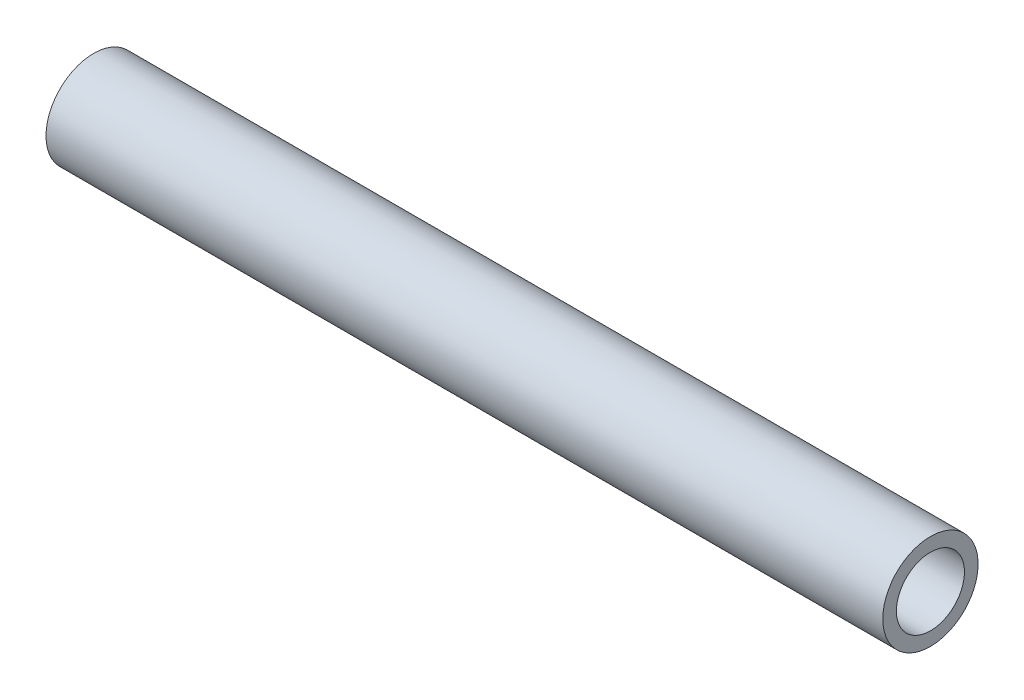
ISO-10303-21;
HEADER;
FILE_DESCRIPTION(('STEP AP214'),'2;1');
FILE_NAME('part.step','',(''),(''),'','','');
FILE_SCHEMA(('AUTOMOTIVE_DESIGN { 1 0 10303 214 1 1 1 1 }'));
ENDSEC;
DATA;
#1=APPLICATION_CONTEXT('core data for automotive mechanical design processes');
#2=APPLICATION_PROTOCOL_DEFINITION('international standard','automotive_design',2000,#1);
#3=PRODUCT_CONTEXT('',#1,'mechanical');
#4=PRODUCT('Part','Part','',(#3));
#5=PRODUCT_RELATED_PRODUCT_CATEGORY('part','',(#4));
#6=PRODUCT_DEFINITION_FORMATION('','',#4);
#7=PRODUCT_DEFINITION_CONTEXT('part definition',#1,'design');
#8=PRODUCT_DEFINITION('design','',#6,#7);
#9=PRODUCT_DEFINITION_SHAPE('','',#8);
#10=(LENGTH_UNIT() NAMED_UNIT(*) SI_UNIT(.MILLI.,.METRE.));
#11=(NAMED_UNIT(*) PLANE_ANGLE_UNIT() SI_UNIT($,.RADIAN.));
#12=(NAMED_UNIT(*) SI_UNIT($,.STERADIAN.) SOLID_ANGLE_UNIT());
#13=UNCERTAINTY_MEASURE_WITH_UNIT(LENGTH_MEASURE(1.E-05),#10,'distance_accuracy_value','');
#14=(GEOMETRIC_REPRESENTATION_CONTEXT(3) GLOBAL_UNCERTAINTY_ASSIGNED_CONTEXT((#13)) GLOBAL_UNIT_ASSIGNED_CONTEXT((#10,
#11,#12)) REPRESENTATION_CONTEXT('',''));
#15=CARTESIAN_POINT('',(0.,0.,0.));
#16=DIRECTION('',(0.,0.,1.));
#17=DIRECTION('',(1.,0.,0.));
#18=AXIS2_PLACEMENT_3D('',#15,#16,#17);
#19=CARTESIAN_POINT('',(187.325,0.,0.));
#20=DIRECTION('',(-1.,0.,0.));
#21=DIRECTION('',(0.,0.,1.));
#22=AXIS2_PLACEMENT_3D('',#19,#20,#21);
#23=CYLINDRICAL_SURFACE('',#22,7.62);
#24=CARTESIAN_POINT('',(187.325,0.,0.));
#25=DIRECTION('',(1.,0.,0.));
#26=DIRECTION('',(0.,0.,-1.));
#27=AXIS2_PLACEMENT_3D('',#24,#25,#26);
#28=CIRCLE('',#27,7.62);
#29=CARTESIAN_POINT('',(187.325,0.,7.62));
#30=VERTEX_POINT('',#29);
#31=EDGE_CURVE('E53',#30,#30,#28,.T.);
#32=CARTESIAN_POINT('',(0.,0.,0.));
#33=DIRECTION('',(1.,0.,0.));
#34=DIRECTION('',(0.,0.,-1.));
#35=AXIS2_PLACEMENT_3D('',#32,#33,#34);
#36=CIRCLE('',#35,7.62);
#37=CARTESIAN_POINT('',(0.,0.,7.62));
#38=VERTEX_POINT('',#37);
#39=EDGE_CURVE('E60',#38,#38,#36,.T.);
#40=CARTESIAN_POINT('',(187.325,0.,7.62));
#41=CARTESIAN_POINT('',(185.373697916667,0.,7.62));
#42=CARTESIAN_POINT('',(183.422395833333,0.,7.62));
#43=CARTESIAN_POINT('',(179.519791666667,0.,7.62));
#44=CARTESIAN_POINT('',(177.568489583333,0.,7.62));
#45=CARTESIAN_POINT('',(173.665885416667,0.,7.62));
#46=CARTESIAN_POINT('',(171.714583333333,0.,7.62));
#47=CARTESIAN_POINT('',(167.811979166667,0.,7.62));
#48=CARTESIAN_POINT('',(165.860677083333,0.,7.62));
#49=CARTESIAN_POINT('',(161.958072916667,0.,7.62));
#50=CARTESIAN_POINT('',(160.006770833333,0.,7.62));
#51=CARTESIAN_POINT('',(156.104166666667,0.,7.62));
#52=CARTESIAN_POINT('',(154.152864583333,0.,7.62));
#53=CARTESIAN_POINT('',(150.250260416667,0.,7.62));
#54=CARTESIAN_POINT('',(148.298958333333,0.,7.62));
#55=CARTESIAN_POINT('',(144.396354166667,0.,7.62));
#56=CARTESIAN_POINT('',(142.445052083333,0.,7.62));
#57=CARTESIAN_POINT('',(138.542447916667,0.,7.62));
#58=CARTESIAN_POINT('',(136.591145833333,0.,7.62));
#59=CARTESIAN_POINT('',(132.688541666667,0.,7.62));
#60=CARTESIAN_POINT('',(130.737239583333,0.,7.62));
#61=CARTESIAN_POINT('',(126.834635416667,0.,7.62));
#62=CARTESIAN_POINT('',(124.883333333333,0.,7.62));
#63=CARTESIAN_POINT('',(120.980729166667,0.,7.62));
#64=CARTESIAN_POINT('',(119.029427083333,0.,7.62));
#65=CARTESIAN_POINT('',(115.126822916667,0.,7.62));
#66=CARTESIAN_POINT('',(113.175520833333,0.,7.62));
#67=CARTESIAN_POINT('',(109.272916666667,0.,7.62));
#68=CARTESIAN_POINT('',(107.321614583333,0.,7.62));
#69=CARTESIAN_POINT('',(103.419010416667,0.,7.62));
#70=CARTESIAN_POINT('',(101.467708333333,0.,7.62));
#71=CARTESIAN_POINT('',(97.5651041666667,0.,7.62));
#72=CARTESIAN_POINT('',(95.6138020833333,0.,7.62));
#73=CARTESIAN_POINT('',(91.7111979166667,0.,7.62));
#74=CARTESIAN_POINT('',(89.7598958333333,0.,7.62));
#75=CARTESIAN_POINT('',(85.8572916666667,0.,7.62));
#76=CARTESIAN_POINT('',(83.9059895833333,0.,7.62));
#77=CARTESIAN_POINT('',(80.0033854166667,0.,7.62));
#78=CARTESIAN_POINT('',(78.0520833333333,0.,7.62));
#79=CARTESIAN_POINT('',(74.1494791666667,0.,7.62));
#80=CARTESIAN_POINT('',(72.1981770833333,0.,7.62));
#81=CARTESIAN_POINT('',(68.2955729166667,0.,7.62));
#82=CARTESIAN_POINT('',(66.3442708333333,0.,7.62));
#83=CARTESIAN_POINT('',(62.4416666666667,0.,7.62));
#84=CARTESIAN_POINT('',(60.4903645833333,0.,7.62));
#85=CARTESIAN_POINT('',(56.5877604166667,0.,7.62));
#86=CARTESIAN_POINT('',(54.6364583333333,0.,7.62));
#87=CARTESIAN_POINT('',(50.7338541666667,0.,7.62));
#88=CARTESIAN_POINT('',(48.7825520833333,0.,7.62));
#89=CARTESIAN_POINT('',(44.8799479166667,0.,7.62));
#90=CARTESIAN_POINT('',(42.9286458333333,0.,7.62));
#91=CARTESIAN_POINT('',(39.0260416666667,0.,7.62));
#92=CARTESIAN_POINT('',(37.0747395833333,0.,7.62));
#93=CARTESIAN_POINT('',(33.1721354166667,0.,7.62));
#94=CARTESIAN_POINT('',(31.2208333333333,0.,7.62));
#95=CARTESIAN_POINT('',(27.3182291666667,0.,7.62));
#96=CARTESIAN_POINT('',(25.3669270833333,0.,7.62));
#97=CARTESIAN_POINT('',(21.4643229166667,0.,7.62));
#98=CARTESIAN_POINT('',(19.5130208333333,0.,7.62));
#99=CARTESIAN_POINT('',(15.6104166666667,0.,7.62));
#100=CARTESIAN_POINT('',(13.6591145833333,0.,7.62));
#101=CARTESIAN_POINT('',(9.75651041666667,0.,7.62));
#102=CARTESIAN_POINT('',(7.80520833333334,0.,7.62));
#103=CARTESIAN_POINT('',(3.90260416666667,0.,7.62));
#104=CARTESIAN_POINT('',(1.95130208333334,0.,7.62));
#105=CARTESIAN_POINT('',(0.,0.,7.62));
#106=B_SPLINE_CURVE_WITH_KNOTS('',3,(#40,#41,#42,#43,#44,#45,#46,#47,#48,#49,#50,#51,#52,#53,
#54,#55,#56,#57,#58,#59,#60,#61,#62,#63,#64,#65,#66,#67,#68,#69,#70,#71,#72,#73,#74,#75,#76,#77,
#78,#79,#80,#81,#82,#83,#84,#85,#86,#87,#88,#89,#90,#91,#92,#93,#94,#95,#96,#97,#98,#99,#100,
#101,#102,#103,#104,#105),.UNSPECIFIED.,.F.,.F.,(4,2,2,2,2,2,2,2,2,2,2,2,2,2,2,2,2,2,2,2,2,2,2,
2,2,2,2,2,2,2,2,2,4),(0.,5.85390624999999,11.7078125,17.56171875,23.415625,29.26953125,
35.1234375,40.97734375,46.83125,52.68515625,58.5390625,64.39296875,70.246875,76.10078125,
81.9546875,87.80859375,93.6625,99.51640625,105.3703125,111.22421875,117.078125,122.93203125,
128.7859375,134.63984375,140.49375,146.34765625,152.2015625,158.05546875,163.909375,
169.76328125,175.6171875,181.47109375,187.325),.UNSPECIFIED.);
#107=EDGE_CURVE('BSEAM45',#30,#38,#106,.T.);
#108=ORIENTED_EDGE('',*,*,#31,.T.);
#109=ORIENTED_EDGE('',*,*,#39,.F.);
#110=ORIENTED_EDGE('',*,*,#107,.T.);
#111=ORIENTED_EDGE('',*,*,#107,.F.);
#112=EDGE_LOOP('',(#108,#110,#109,#111));
#113=FACE_BOUND('',#112,.T.);
#114=ADVANCED_FACE('F45',(#113),#23,.F.);
#115=CARTESIAN_POINT('',(187.325,0.,0.));
#116=DIRECTION('',(-1.,0.,0.));
#117=DIRECTION('',(0.,0.,1.));
#118=AXIS2_PLACEMENT_3D('',#115,#116,#117);
#119=CYLINDRICAL_SURFACE('',#118,10.668);
#120=CARTESIAN_POINT('',(187.325,0.,0.));
#121=DIRECTION('',(1.,0.,0.));
#122=DIRECTION('',(0.,0.,-1.));
#123=AXIS2_PLACEMENT_3D('',#120,#121,#122);
#124=CIRCLE('',#123,10.668);
#125=CARTESIAN_POINT('',(187.325,0.,10.668));
#126=VERTEX_POINT('',#125);
#127=EDGE_CURVE('E10',#126,#126,#124,.T.);
#128=CARTESIAN_POINT('',(0.,0.,0.));
#129=DIRECTION('',(1.,0.,0.));
#130=DIRECTION('',(0.,0.,-1.));
#131=AXIS2_PLACEMENT_3D('',#128,#129,#130);
#132=CIRCLE('',#131,10.668);
#133=CARTESIAN_POINT('',(0.,0.,10.668));
#134=VERTEX_POINT('',#133);
#135=EDGE_CURVE('E48',#134,#134,#132,.T.);
#136=CARTESIAN_POINT('',(187.325,0.,10.668));
#137=CARTESIAN_POINT('',(185.373697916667,0.,10.668));
#138=CARTESIAN_POINT('',(183.422395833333,0.,10.668));
#139=CARTESIAN_POINT('',(179.519791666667,0.,10.668));
#140=CARTESIAN_POINT('',(177.568489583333,0.,10.668));
#141=CARTESIAN_POINT('',(173.665885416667,0.,10.668));
#142=CARTESIAN_POINT('',(171.714583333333,0.,10.668));
#143=CARTESIAN_POINT('',(167.811979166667,0.,10.668));
#144=CARTESIAN_POINT('',(165.860677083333,0.,10.668));
#145=CARTESIAN_POINT('',(161.958072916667,0.,10.668));
#146=CARTESIAN_POINT('',(160.006770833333,0.,10.668));
#147=CARTESIAN_POINT('',(156.104166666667,0.,10.668));
#148=CARTESIAN_POINT('',(154.152864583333,0.,10.668));
#149=CARTESIAN_POINT('',(150.250260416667,0.,10.668));
#150=CARTESIAN_POINT('',(148.298958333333,0.,10.668));
#151=CARTESIAN_POINT('',(144.396354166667,0.,10.668));
#152=CARTESIAN_POINT('',(142.445052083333,0.,10.668));
#153=CARTESIAN_POINT('',(138.542447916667,0.,10.668));
#154=CARTESIAN_POINT('',(136.591145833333,0.,10.668));
#155=CARTESIAN_POINT('',(132.688541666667,0.,10.668));
#156=CARTESIAN_POINT('',(130.737239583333,0.,10.668));
#157=CARTESIAN_POINT('',(126.834635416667,0.,10.668));
#158=CARTESIAN_POINT('',(124.883333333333,0.,10.668));
#159=CARTESIAN_POINT('',(120.980729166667,0.,10.668));
#160=CARTESIAN_POINT('',(119.029427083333,0.,10.668));
#161=CARTESIAN_POINT('',(115.126822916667,0.,10.668));
#162=CARTESIAN_POINT('',(113.175520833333,0.,10.668));
#163=CARTESIAN_POINT('',(109.272916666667,0.,10.668));
#164=CARTESIAN_POINT('',(107.321614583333,0.,10.668));
#165=CARTESIAN_POINT('',(103.419010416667,0.,10.668));
#166=CARTESIAN_POINT('',(101.467708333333,0.,10.668));
#167=CARTESIAN_POINT('',(97.5651041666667,0.,10.668));
#168=CARTESIAN_POINT('',(95.6138020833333,0.,10.668));
#169=CARTESIAN_POINT('',(91.7111979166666,0.,10.668));
#170=CARTESIAN_POINT('',(89.7598958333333,0.,10.668));
#171=CARTESIAN_POINT('',(85.8572916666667,0.,10.668));
#172=CARTESIAN_POINT('',(83.9059895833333,0.,10.668));
#173=CARTESIAN_POINT('',(80.0033854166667,0.,10.668));
#174=CARTESIAN_POINT('',(78.0520833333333,0.,10.668));
#175=CARTESIAN_POINT('',(74.1494791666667,0.,10.668));
#176=CARTESIAN_POINT('',(72.1981770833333,0.,10.668));
#177=CARTESIAN_POINT('',(68.2955729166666,0.,10.668));
#178=CARTESIAN_POINT('',(66.3442708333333,0.,10.668));
#179=CARTESIAN_POINT('',(62.4416666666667,0.,10.668));
#180=CARTESIAN_POINT('',(60.4903645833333,0.,10.668));
#181=CARTESIAN_POINT('',(56.5877604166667,0.,10.668));
#182=CARTESIAN_POINT('',(54.6364583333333,0.,10.668));
#183=CARTESIAN_POINT('',(50.7338541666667,0.,10.668));
#184=CARTESIAN_POINT('',(48.7825520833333,0.,10.668));
#185=CARTESIAN_POINT('',(44.8799479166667,0.,10.668));
#186=CARTESIAN_POINT('',(42.9286458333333,0.,10.668));
#187=CARTESIAN_POINT('',(39.0260416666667,0.,10.668));
#188=CARTESIAN_POINT('',(37.0747395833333,0.,10.668));
#189=CARTESIAN_POINT('',(33.1721354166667,0.,10.668));
#190=CARTESIAN_POINT('',(31.2208333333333,0.,10.668));
#191=CARTESIAN_POINT('',(27.3182291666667,0.,10.668));
#192=CARTESIAN_POINT('',(25.3669270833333,0.,10.668));
#193=CARTESIAN_POINT('',(21.4643229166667,0.,10.668));
#194=CARTESIAN_POINT('',(19.5130208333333,0.,10.668));
#195=CARTESIAN_POINT('',(15.6104166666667,0.,10.668));
#196=CARTESIAN_POINT('',(13.6591145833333,0.,10.668));
#197=CARTESIAN_POINT('',(9.75651041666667,0.,10.668));
#198=CARTESIAN_POINT('',(7.80520833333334,0.,10.668));
#199=CARTESIAN_POINT('',(3.90260416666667,0.,10.668));
#200=CARTESIAN_POINT('',(1.95130208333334,0.,10.668));
#201=CARTESIAN_POINT('',(0.,0.,10.668));
#202=B_SPLINE_CURVE_WITH_KNOTS('',3,(#136,#137,#138,#139,#140,#141,#142,#143,#144,#145,#146,
#147,#148,#149,#150,#151,#152,#153,#154,#155,#156,#157,#158,#159,#160,#161,#162,#163,#164,#165,
#166,#167,#168,#169,#170,#171,#172,#173,#174,#175,#176,#177,#178,#179,#180,#181,#182,#183,#184,
#185,#186,#187,#188,#189,#190,#191,#192,#193,#194,#195,#196,#197,#198,#199,#200,#201),
.UNSPECIFIED.,.F.,.F.,(4,2,2,2,2,2,2,2,2,2,2,2,2,2,2,2,2,2,2,2,2,2,2,2,2,2,2,2,2,2,2,2,4),(0.,
5.85390625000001,11.7078125,17.56171875,23.415625,29.26953125,35.1234375,40.97734375,46.83125,
52.68515625,58.5390625,64.39296875,70.246875,76.10078125,81.9546875,87.80859375,93.6625,
99.51640625,105.3703125,111.22421875,117.078125,122.93203125,128.7859375,134.63984375,140.49375,
146.34765625,152.2015625,158.05546875,163.909375,169.76328125,175.6171875,181.47109375,187.325),.UNSPECIFIED.);
#203=EDGE_CURVE('BSEAM69',#126,#134,#202,.T.);
#204=ORIENTED_EDGE('',*,*,#127,.F.);
#205=ORIENTED_EDGE('',*,*,#135,.T.);
#206=ORIENTED_EDGE('',*,*,#203,.T.);
#207=ORIENTED_EDGE('',*,*,#203,.F.);
#208=EDGE_LOOP('',(#204,#206,#205,#207));
#209=FACE_BOUND('',#208,.T.);
#210=ADVANCED_FACE('F69',(#209),#119,.T.);
#211=CARTESIAN_POINT('',(187.325,0.,0.));
#212=DIRECTION('',(1.,0.,0.));
#213=DIRECTION('',(0.,0.,-1.));
#214=AXIS2_PLACEMENT_3D('',#211,#212,#213);
#215=PLANE('',#214);
#216=ORIENTED_EDGE('',*,*,#31,.F.);
#217=EDGE_LOOP('',(#216));
#218=FACE_BOUND('',#217,.T.);
#219=ORIENTED_EDGE('',*,*,#127,.T.);
#220=EDGE_LOOP('',(#219));
#221=FACE_BOUND('',#220,.T.);
#222=ADVANCED_FACE('F73',(#218,#221),#215,.T.);
#223=CARTESIAN_POINT('',(0.,0.,0.));
#224=DIRECTION('',(1.,0.,0.));
#225=DIRECTION('',(0.,0.,-1.));
#226=AXIS2_PLACEMENT_3D('',#223,#224,#225);
#227=PLANE('',#226);
#228=ORIENTED_EDGE('',*,*,#39,.T.);
#229=EDGE_LOOP('',(#228));
#230=FACE_BOUND('',#229,.T.);
#231=ORIENTED_EDGE('',*,*,#135,.F.);
#232=EDGE_LOOP('',(#231));
#233=FACE_BOUND('',#232,.T.);
#234=ADVANCED_FACE('F71',(#230,#233),#227,.F.);
#235=CLOSED_SHELL('',(#114,#210,#222,#234));
#236=MANIFOLD_SOLID_BREP('B2',#235);
#237=ADVANCED_BREP_SHAPE_REPRESENTATION('',(#18,#236),#14);
#238=SHAPE_DEFINITION_REPRESENTATION(#9,#237);
ENDSEC;
END-ISO-10303-21;
